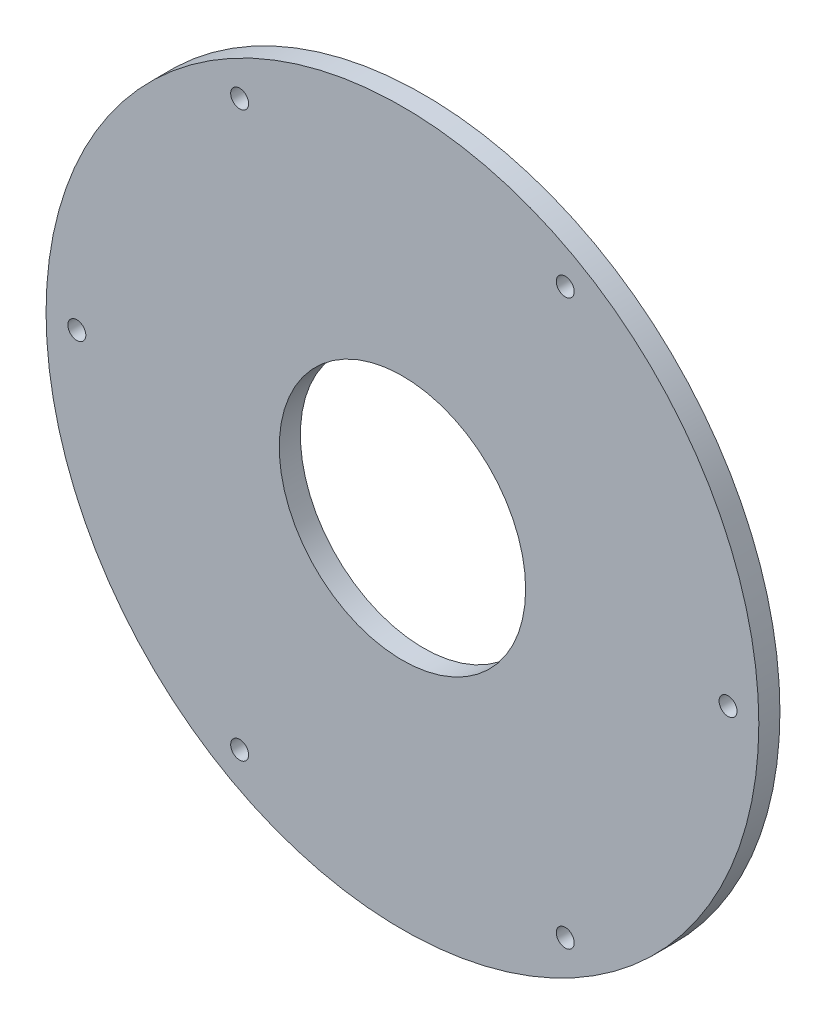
from build123d import *

# Parameters (mm, degrees)
SKETCH1_R           = 202.5
SKETCH1_R_2         = 70
BOSS_EXTRUDE1_DEPTH = 12
M12_TAPPED_HOLE1_D  = 10.2
CIRPATTERN1_COUNT   = 6


with BuildPart() as part:
    # Sketch1 → Boss-Extrude1 (new body)
    with BuildSketch(Plane.XY):
        Circle(SKETCH1_R)
        Circle(SKETCH1_R_2, mode=Mode.SUBTRACT)
    extrude(amount=BOSS_EXTRUDE1_DEPTH)

    # M12 Tapped Hole1 (through all)
    with Locations(Plane.XY.offset(12)):
        with Locations((-185, 0)):
            m12_tapped_hole1 = Hole(M12_TAPPED_HOLE1_D / 2)

    # CirPattern1: M12 Tapped Hole1 ×6 about axis
    cirpattern1_axis = Axis((0, 0, 0), (0, 0, 1))
    for i in range(1, CIRPATTERN1_COUNT):
        add(m12_tapped_hole1.rotate(cirpattern1_axis, i * 360 / CIRPATTERN1_COUNT), mode=Mode.SUBTRACT)


solid = part.part
